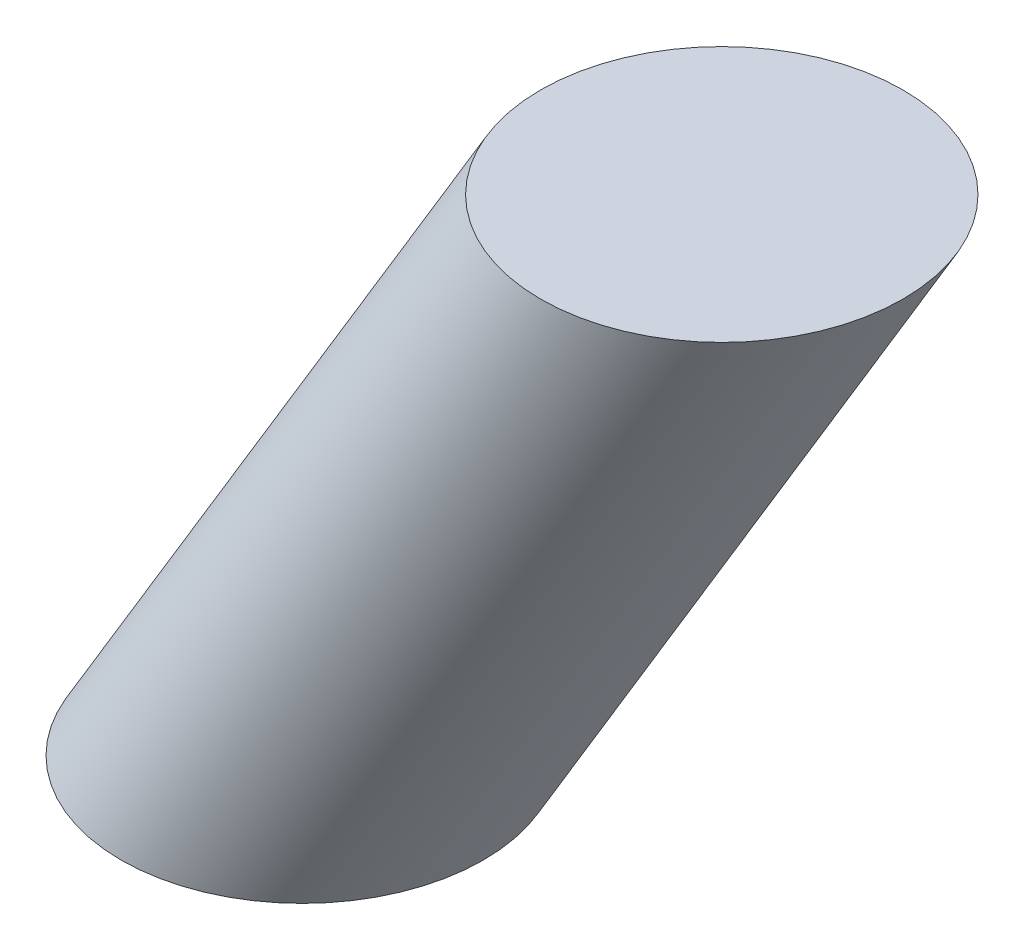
ISO-10303-21;
HEADER;
FILE_DESCRIPTION(('STEP AP214'),'2;1');
FILE_NAME('part.step','',(''),(''),'','','');
FILE_SCHEMA(('AUTOMOTIVE_DESIGN { 1 0 10303 214 1 1 1 1 }'));
ENDSEC;
DATA;
#1=APPLICATION_CONTEXT('core data for automotive mechanical design processes');
#2=APPLICATION_PROTOCOL_DEFINITION('international standard','automotive_design',2000,#1);
#3=PRODUCT_CONTEXT('',#1,'mechanical');
#4=PRODUCT('Part','Part','',(#3));
#5=PRODUCT_RELATED_PRODUCT_CATEGORY('part','',(#4));
#6=PRODUCT_DEFINITION_FORMATION('','',#4);
#7=PRODUCT_DEFINITION_CONTEXT('part definition',#1,'design');
#8=PRODUCT_DEFINITION('design','',#6,#7);
#9=PRODUCT_DEFINITION_SHAPE('','',#8);
#10=(LENGTH_UNIT() NAMED_UNIT(*) SI_UNIT(.MILLI.,.METRE.));
#11=(NAMED_UNIT(*) PLANE_ANGLE_UNIT() SI_UNIT($,.RADIAN.));
#12=(NAMED_UNIT(*) SI_UNIT($,.STERADIAN.) SOLID_ANGLE_UNIT());
#13=UNCERTAINTY_MEASURE_WITH_UNIT(LENGTH_MEASURE(1.E-05),#10,'distance_accuracy_value','');
#14=(GEOMETRIC_REPRESENTATION_CONTEXT(3) GLOBAL_UNCERTAINTY_ASSIGNED_CONTEXT((#13)) GLOBAL_UNIT_ASSIGNED_CONTEXT((#10,
#11,#12)) REPRESENTATION_CONTEXT('',''));
#15=CARTESIAN_POINT('',(0.,0.,0.));
#16=DIRECTION('',(0.,0.,1.));
#17=DIRECTION('',(1.,0.,0.));
#18=AXIS2_PLACEMENT_3D('',#15,#16,#17);
#19=CARTESIAN_POINT('',(51.4867907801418,85.3647163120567,0.));
#20=DIRECTION('',(0.,1.,0.));
#21=DIRECTION('',(0.,0.,1.));
#22=AXIS2_PLACEMENT_3D('',#19,#20,#21);
#23=CIRCLE('',#22,22.234217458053);
#24=DIRECTION('',(-0.516470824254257,-0.85630478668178,0.));
#25=VECTOR('',#24,1.);
#26=SURFACE_OF_LINEAR_EXTRUSION('',#23,#25);
#27=CARTESIAN_POINT('',(51.4867907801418,85.3647163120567,22.234217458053));
#28=VERTEX_POINT('',#27);
#29=EDGE_CURVE('E10',#28,#28,#23,.T.);
#30=ORIENTED_EDGE('',*,*,#29,.F.);
#31=EDGE_LOOP('',(#30));
#32=FACE_BOUND('',#31,.T.);
#33=CARTESIAN_POINT('',(0.,0.,0.));
#34=DIRECTION('',(0.,1.,0.));
#35=DIRECTION('',(0.,0.,1.));
#36=AXIS2_PLACEMENT_3D('',#33,#34,#35);
#37=CIRCLE('',#36,22.234217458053);
#38=CARTESIAN_POINT('',(0.,0.,22.234217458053));
#39=VERTEX_POINT('',#38);
#40=EDGE_CURVE('E36',#39,#39,#37,.T.);
#41=ORIENTED_EDGE('',*,*,#40,.T.);
#42=EDGE_LOOP('',(#41));
#43=FACE_BOUND('',#42,.T.);
#44=ADVANCED_FACE('F29',(#32,#43),#26,.F.);
#45=CARTESIAN_POINT('',(51.4867907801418,85.3647163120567,0.));
#46=DIRECTION('',(0.,1.,0.));
#47=DIRECTION('',(0.,0.,1.));
#48=AXIS2_PLACEMENT_3D('',#45,#46,#47);
#49=PLANE('',#48);
#50=ORIENTED_EDGE('',*,*,#29,.T.);
#51=EDGE_LOOP('',(#50));
#52=FACE_BOUND('',#51,.T.);
#53=ADVANCED_FACE('F45',(#52),#49,.T.);
#54=CARTESIAN_POINT('',(0.,0.,0.));
#55=DIRECTION('',(0.,1.,0.));
#56=DIRECTION('',(0.,0.,1.));
#57=AXIS2_PLACEMENT_3D('',#54,#55,#56);
#58=PLANE('',#57);
#59=ORIENTED_EDGE('',*,*,#40,.F.);
#60=EDGE_LOOP('',(#59));
#61=FACE_BOUND('',#60,.T.);
#62=ADVANCED_FACE('F43',(#61),#58,.F.);
#63=CLOSED_SHELL('',(#44,#53,#62));
#64=MANIFOLD_SOLID_BREP('B2',#63);
#65=ADVANCED_BREP_SHAPE_REPRESENTATION('',(#18,#64),#14);
#66=SHAPE_DEFINITION_REPRESENTATION(#9,#65);
ENDSEC;
END-ISO-10303-21;
